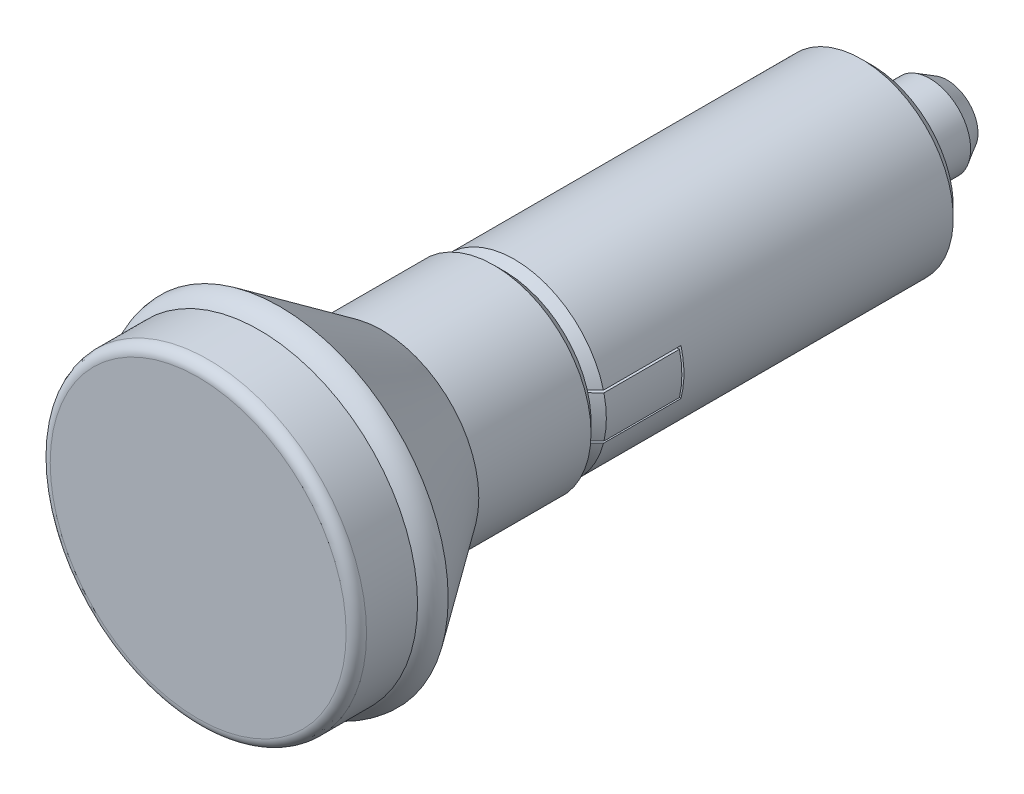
ISO-10303-21;
HEADER;
FILE_DESCRIPTION(('STEP AP214'),'2;1');
FILE_NAME('part.step','',(''),(''),'','','');
FILE_SCHEMA(('AUTOMOTIVE_DESIGN { 1 0 10303 214 1 1 1 1 }'));
ENDSEC;
DATA;
#1=APPLICATION_CONTEXT('core data for automotive mechanical design processes');
#2=APPLICATION_PROTOCOL_DEFINITION('international standard','automotive_design',2000,#1);
#3=PRODUCT_CONTEXT('',#1,'mechanical');
#4=PRODUCT('Part','Part','',(#3));
#5=PRODUCT_RELATED_PRODUCT_CATEGORY('part','',(#4));
#6=PRODUCT_DEFINITION_FORMATION('','',#4);
#7=PRODUCT_DEFINITION_CONTEXT('part definition',#1,'design');
#8=PRODUCT_DEFINITION('design','',#6,#7);
#9=PRODUCT_DEFINITION_SHAPE('','',#8);
#10=(LENGTH_UNIT() NAMED_UNIT(*) SI_UNIT(.MILLI.,.METRE.));
#11=(NAMED_UNIT(*) PLANE_ANGLE_UNIT() SI_UNIT($,.RADIAN.));
#12=(NAMED_UNIT(*) SI_UNIT($,.STERADIAN.) SOLID_ANGLE_UNIT());
#13=UNCERTAINTY_MEASURE_WITH_UNIT(LENGTH_MEASURE(1.E-05),#10,'distance_accuracy_value','');
#14=(GEOMETRIC_REPRESENTATION_CONTEXT(3) GLOBAL_UNCERTAINTY_ASSIGNED_CONTEXT((#13)) GLOBAL_UNIT_ASSIGNED_CONTEXT((#10,
#11,#12)) REPRESENTATION_CONTEXT('',''));
#15=CARTESIAN_POINT('',(0.,0.,0.));
#16=DIRECTION('',(0.,0.,1.));
#17=DIRECTION('',(1.,0.,0.));
#18=AXIS2_PLACEMENT_3D('',#15,#16,#17);
#19=CARTESIAN_POINT('',(0.,0.,36.));
#20=DIRECTION('',(0.,0.,-1.));
#21=DIRECTION('',(1.,0.,0.));
#22=AXIS2_PLACEMENT_3D('',#19,#20,#21);
#23=CONICAL_SURFACE('',#22,8.,0.785398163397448);
#24=CARTESIAN_POINT('',(4.36301272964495,-2.25,39.0909899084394));
#25=CARTESIAN_POINT('',(4.50246665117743,-2.25,38.9670205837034));
#26=CARTESIAN_POINT('',(4.64132469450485,-2.25,38.8423852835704));
#27=CARTESIAN_POINT('',(4.91805103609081,-2.25,38.5920260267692));
#28=CARTESIAN_POINT('',(5.05591935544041,-2.25,38.4663020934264));
#29=CARTESIAN_POINT('',(5.3308650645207,-2.25,38.2140119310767));
#30=CARTESIAN_POINT('',(5.46794250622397,-2.25,38.0874457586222));
#31=CARTESIAN_POINT('',(5.74145630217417,-2.25,37.8336212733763));
#32=CARTESIAN_POINT('',(5.87789265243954,-2.25,37.7063629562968));
#33=CARTESIAN_POINT('',(6.2863839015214,-2.25,37.3237757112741));
#34=CARTESIAN_POINT('',(6.55765152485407,-2.25,37.0676063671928));
#35=CARTESIAN_POINT('',(7.09871858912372,-2.25,36.5537134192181));
#36=CARTESIAN_POINT('',(7.36851799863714,-2.25,36.2959897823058));
#37=CARTESIAN_POINT('',(7.92302738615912,-2.25,35.7640811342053));
#38=CARTESIAN_POINT('',(8.20767141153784,-2.25,35.4898274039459));
#39=CARTESIAN_POINT('',(8.77606216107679,-2.25,34.9403915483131));
#40=CARTESIAN_POINT('',(9.05980888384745,-2.25,34.6652094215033));
#41=CARTESIAN_POINT('',(9.91003670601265,-2.25,33.8386250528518));
#42=CARTESIAN_POINT('',(10.475506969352,-2.25,33.2861833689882));
#43=CARTESIAN_POINT('',(11.6049167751,-2.25,32.1795069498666));
#44=CARTESIAN_POINT('',(12.1688559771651,-2.25,31.6252718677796));
#45=CARTESIAN_POINT('',(13.0139348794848,-2.25,30.7930842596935));
#46=CARTESIAN_POINT('',(13.2954876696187,-2.25,30.5155510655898));
#47=CARTESIAN_POINT('',(13.8583614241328,-2.25,29.9602501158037));
#48=CARTESIAN_POINT('',(14.1396823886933,-2.25,29.682482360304));
#49=CARTESIAN_POINT('',(14.4209094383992,-2.25,29.4046195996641));
#50=B_SPLINE_CURVE_WITH_KNOTS('',3,(#24,#25,#26,#27,#28,#29,#30,#31,#32,#33,#34,#35,#36,#37,#38,
#39,#40,#41,#42,#43,#44,#45,#46,#47,#48,#49),.UNSPECIFIED.,.F.,.F.,(4,2,2,2,2,2,2,2,2,2,2,2,4),
(0.,0.559763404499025,1.11951484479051,1.67922907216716,2.23894677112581,3.35825765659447,
4.47759240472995,5.66339545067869,6.84920033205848,9.22080380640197,11.5928972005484,
12.778928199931,13.9649582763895),.UNSPECIFIED.);
#51=CARTESIAN_POINT('',(7.67707626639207,-2.25,36.));
#52=VERTEX_POINT('',#51);
#53=CARTESIAN_POINT('',(8.71421252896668,-2.25,35.));
#54=VERTEX_POINT('',#53);
#55=EDGE_CURVE('E37',#52,#54,#50,.T.);
#56=ORIENTED_EDGE('',*,*,#55,.F.);
#57=CARTESIAN_POINT('',(0.,0.,36.));
#58=DIRECTION('',(0.,0.,1.));
#59=DIRECTION('',(-1.,0.,0.));
#60=AXIS2_PLACEMENT_3D('',#57,#58,#59);
#61=CIRCLE('',#60,8.);
#62=CARTESIAN_POINT('',(7.67707626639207,2.25,36.));
#63=VERTEX_POINT('',#62);
#64=EDGE_CURVE('E208',#63,#52,#61,.T.);
#65=ORIENTED_EDGE('',*,*,#64,.F.);
#66=CARTESIAN_POINT('',(14.4209094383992,2.25,29.4046195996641));
#67=CARTESIAN_POINT('',(14.1396823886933,2.25,29.682482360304));
#68=CARTESIAN_POINT('',(13.8583614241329,2.25,29.9602501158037));
#69=CARTESIAN_POINT('',(13.2954876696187,2.25,30.5155510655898));
#70=CARTESIAN_POINT('',(13.0139348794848,2.25,30.7930842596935));
#71=CARTESIAN_POINT('',(12.1688559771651,2.25,31.6252718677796));
#72=CARTESIAN_POINT('',(11.6049167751,2.25,32.1795069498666));
#73=CARTESIAN_POINT('',(10.475506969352,2.25,33.2861833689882));
#74=CARTESIAN_POINT('',(9.91003670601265,2.25,33.8386250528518));
#75=CARTESIAN_POINT('',(9.05980888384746,2.25,34.6652094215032));
#76=CARTESIAN_POINT('',(8.77606216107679,2.25,34.9403915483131));
#77=CARTESIAN_POINT('',(8.20767141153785,2.25,35.4898274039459));
#78=CARTESIAN_POINT('',(7.92302738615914,2.25,35.7640811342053));
#79=CARTESIAN_POINT('',(7.36851799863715,2.25,36.2959897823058));
#80=CARTESIAN_POINT('',(7.09871858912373,2.25,36.5537134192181));
#81=CARTESIAN_POINT('',(6.55765152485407,2.25,37.0676063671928));
#82=CARTESIAN_POINT('',(6.2863839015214,2.25,37.3237757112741));
#83=CARTESIAN_POINT('',(5.87789265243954,2.25,37.7063629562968));
#84=CARTESIAN_POINT('',(5.74145630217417,2.25,37.8336212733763));
#85=CARTESIAN_POINT('',(5.46794250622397,2.25,38.0874457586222));
#86=CARTESIAN_POINT('',(5.3308650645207,2.25,38.2140119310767));
#87=CARTESIAN_POINT('',(5.05591935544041,2.25,38.4663020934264));
#88=CARTESIAN_POINT('',(4.91805103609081,2.25,38.5920260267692));
#89=CARTESIAN_POINT('',(4.64132469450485,2.25,38.8423852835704));
#90=CARTESIAN_POINT('',(4.50246665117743,2.25,38.9670205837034));
#91=CARTESIAN_POINT('',(4.36301272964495,2.25,39.0909899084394));
#92=B_SPLINE_CURVE_WITH_KNOTS('',3,(#66,#67,#68,#69,#70,#71,#72,#73,#74,#75,#76,#77,#78,#79,#80,
#81,#82,#83,#84,#85,#86,#87,#88,#89,#90,#91),.UNSPECIFIED.,.F.,.F.,(4,2,2,2,2,2,2,2,2,2,2,2,4),
(0.,1.18603007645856,2.37206107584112,4.74415446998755,7.11575794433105,8.30156282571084,
9.48736587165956,10.6067006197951,11.7260115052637,12.2857292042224,12.845443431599,
13.4051948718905,13.9649582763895),.UNSPECIFIED.);
#93=CARTESIAN_POINT('',(8.71421252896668,2.25,35.));
#94=VERTEX_POINT('',#93);
#95=EDGE_CURVE('E130',#94,#63,#92,.T.);
#96=ORIENTED_EDGE('',*,*,#95,.F.);
#97=CARTESIAN_POINT('',(0.,0.,35.));
#98=DIRECTION('',(0.,0.,1.));
#99=DIRECTION('',(-1.,0.,0.));
#100=AXIS2_PLACEMENT_3D('',#97,#98,#99);
#101=CIRCLE('',#100,9.);
#102=EDGE_CURVE('E210',#94,#54,#101,.T.);
#103=ORIENTED_EDGE('',*,*,#102,.T.);
#104=EDGE_LOOP('',(#56,#65,#96,#103));
#105=FACE_BOUND('',#104,.T.);
#106=ADVANCED_FACE('F14',(#105),#23,.T.);
#107=CARTESIAN_POINT('',(0.,0.,66.));
#108=DIRECTION('',(0.,0.,1.));
#109=DIRECTION('',(-1.,0.,0.));
#110=AXIS2_PLACEMENT_3D('',#107,#108,#109);
#111=CYLINDRICAL_SURFACE('',#110,9.);
#112=CARTESIAN_POINT('',(0.,0.,27.6));
#113=DIRECTION('',(0.,0.,1.));
#114=DIRECTION('',(-1.,0.,0.));
#115=AXIS2_PLACEMENT_3D('',#112,#113,#114);
#116=CIRCLE('',#115,9.);
#117=CARTESIAN_POINT('',(8.76341828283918,2.05,27.6));
#118=VERTEX_POINT('',#117);
#119=CARTESIAN_POINT('',(8.76341828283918,-2.05,27.6));
#120=VERTEX_POINT('',#119);
#121=EDGE_CURVE('E246',#118,#120,#116,.F.);
#122=ORIENTED_EDGE('',*,*,#121,.F.);
#123=DIRECTION('',(0.,0.,1.));
#124=VECTOR('',#123,1.);
#125=CARTESIAN_POINT('',(8.76341828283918,2.05,66.));
#126=LINE('',#125,#124);
#127=CARTESIAN_POINT('',(8.76341828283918,2.05,35.));
#128=VERTEX_POINT('',#127);
#129=EDGE_CURVE('E9',#128,#118,#126,.F.);
#130=ORIENTED_EDGE('',*,*,#129,.F.);
#131=CARTESIAN_POINT('',(8.76341828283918,-2.05,35.));
#132=VERTEX_POINT('',#131);
#133=EDGE_CURVE('E218',#132,#128,#101,.T.);
#134=ORIENTED_EDGE('',*,*,#133,.F.);
#135=DIRECTION('',(0.,0.,1.));
#136=VECTOR('',#135,1.);
#137=CARTESIAN_POINT('',(8.76341828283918,-2.05,66.));
#138=LINE('',#137,#136);
#139=EDGE_CURVE('E248',#120,#132,#138,.T.);
#140=ORIENTED_EDGE('',*,*,#139,.F.);
#141=EDGE_LOOP('',(#122,#130,#134,#140));
#142=FACE_BOUND('',#141,.T.);
#143=ADVANCED_FACE('F190',(#142),#111,.T.);
#144=CARTESIAN_POINT('',(0.,0.,1.25141216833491E-10));
#145=DIRECTION('',(0.,0.,1.));
#146=DIRECTION('',(0.,-1.,0.));
#147=AXIS2_PLACEMENT_3D('',#144,#145,#146);
#148=SPHERICAL_SURFACE('',#147,8.);
#149=CARTESIAN_POINT('',(0.,0.,-7.4113534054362));
#150=DIRECTION('',(0.,0.,1.));
#151=DIRECTION('',(-1.,0.,0.));
#152=AXIS2_PLACEMENT_3D('',#149,#150,#151);
#153=CIRCLE('',#152,3.01194965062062);
#154=CARTESIAN_POINT('',(-3.01194965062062,0.,-7.4113534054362));
#155=VERTEX_POINT('',#154);
#156=EDGE_CURVE('E211',#155,#155,#153,.T.);
#157=ORIENTED_EDGE('',*,*,#156,.F.);
#158=EDGE_LOOP('',(#157));
#159=FACE_BOUND('',#158,.T.);
#160=ADVANCED_FACE('F16',(#159),#148,.T.);
#161=CARTESIAN_POINT('',(0.,-14.5,66.));
#162=DIRECTION('',(0.,0.,1.));
#163=DIRECTION('',(-1.,0.,0.));
#164=AXIS2_PLACEMENT_3D('',#161,#162,#163);
#165=PLANE('',#164);
#166=CARTESIAN_POINT('',(0.,0.,66.));
#167=DIRECTION('',(0.,0.,1.));
#168=DIRECTION('',(-1.,0.,0.));
#169=AXIS2_PLACEMENT_3D('',#166,#167,#168);
#170=CIRCLE('',#169,14.5);
#171=CARTESIAN_POINT('',(-14.5,0.,66.));
#172=VERTEX_POINT('',#171);
#173=EDGE_CURVE('E243',#172,#172,#170,.T.);
#174=ORIENTED_EDGE('',*,*,#173,.T.);
#175=EDGE_LOOP('',(#174));
#176=FACE_BOUND('',#175,.T.);
#177=ADVANCED_FACE('F383',(#176),#165,.T.);
#178=CARTESIAN_POINT('',(0.,0.,65.));
#179=DIRECTION('',(0.,0.,1.));
#180=DIRECTION('',(-1.,0.,0.));
#181=AXIS2_PLACEMENT_3D('',#178,#179,#180);
#182=TOROIDAL_SURFACE('',#181,14.5,1.);
#183=CARTESIAN_POINT('',(0.,0.,65.));
#184=DIRECTION('',(0.,0.,1.));
#185=DIRECTION('',(-1.,0.,0.));
#186=AXIS2_PLACEMENT_3D('',#183,#184,#185);
#187=CIRCLE('',#186,15.5);
#188=CARTESIAN_POINT('',(-15.5,0.,65.));
#189=VERTEX_POINT('',#188);
#190=EDGE_CURVE('E240',#189,#189,#187,.T.);
#191=ORIENTED_EDGE('',*,*,#190,.T.);
#192=EDGE_LOOP('',(#191));
#193=FACE_BOUND('',#192,.T.);
#194=ORIENTED_EDGE('',*,*,#173,.F.);
#195=EDGE_LOOP('',(#194));
#196=FACE_BOUND('',#195,.T.);
#197=ADVANCED_FACE('F374',(#193,#196),#182,.T.);
#198=CARTESIAN_POINT('',(0.,0.,66.));
#199=DIRECTION('',(0.,0.,1.));
#200=DIRECTION('',(-1.,0.,0.));
#201=AXIS2_PLACEMENT_3D('',#198,#199,#200);
#202=CYLINDRICAL_SURFACE('',#201,15.5);
#203=CARTESIAN_POINT('',(0.,0.,60.));
#204=DIRECTION('',(0.,0.,1.));
#205=DIRECTION('',(-1.,0.,0.));
#206=AXIS2_PLACEMENT_3D('',#203,#204,#205);
#207=CIRCLE('',#206,15.5);
#208=CARTESIAN_POINT('',(-15.5,0.,60.));
#209=VERTEX_POINT('',#208);
#210=EDGE_CURVE('E237',#209,#209,#207,.T.);
#211=ORIENTED_EDGE('',*,*,#210,.T.);
#212=EDGE_LOOP('',(#211));
#213=FACE_BOUND('',#212,.T.);
#214=ORIENTED_EDGE('',*,*,#190,.F.);
#215=EDGE_LOOP('',(#214));
#216=FACE_BOUND('',#215,.T.);
#217=ADVANCED_FACE('F365',(#213,#216),#202,.T.);
#218=CARTESIAN_POINT('',(0.,0.,58.));
#219=DIRECTION('',(0.,0.,1.));
#220=DIRECTION('',(-1.,0.,0.));
#221=AXIS2_PLACEMENT_3D('',#218,#219,#220);
#222=TOROIDAL_SURFACE('',#221,14.0000000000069,2.49999999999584);
#223=CARTESIAN_POINT('',(0.,0.,58.));
#224=DIRECTION('',(0.,0.,1.));
#225=DIRECTION('',(-1.,0.,0.));
#226=AXIS2_PLACEMENT_3D('',#223,#224,#225);
#227=CIRCLE('',#226,16.5000000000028);
#228=CARTESIAN_POINT('',(-16.5000000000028,0.,58.));
#229=VERTEX_POINT('',#228);
#230=EDGE_CURVE('E234',#229,#229,#227,.T.);
#231=ORIENTED_EDGE('',*,*,#230,.T.);
#232=EDGE_LOOP('',(#231));
#233=FACE_BOUND('',#232,.T.);
#234=ORIENTED_EDGE('',*,*,#210,.F.);
#235=EDGE_LOOP('',(#234));
#236=FACE_BOUND('',#235,.T.);
#237=ADVANCED_FACE('F356',(#233,#236),#222,.T.);
#238=CARTESIAN_POINT('',(0.,0.,58.));
#239=DIRECTION('',(0.,0.,1.));
#240=DIRECTION('',(-1.,0.,0.));
#241=AXIS2_PLACEMENT_3D('',#238,#239,#240);
#242=CONICAL_SURFACE('',#241,16.5000000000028,0.610725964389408);
#243=CARTESIAN_POINT('',(0.,0.,48.));
#244=DIRECTION('',(0.,0.,1.));
#245=DIRECTION('',(-1.,0.,0.));
#246=AXIS2_PLACEMENT_3D('',#243,#244,#245);
#247=CIRCLE('',#246,9.5);
#248=CARTESIAN_POINT('',(-9.5,0.,48.));
#249=VERTEX_POINT('',#248);
#250=EDGE_CURVE('E231',#249,#249,#247,.T.);
#251=ORIENTED_EDGE('',*,*,#250,.T.);
#252=EDGE_LOOP('',(#251));
#253=FACE_BOUND('',#252,.T.);
#254=ORIENTED_EDGE('',*,*,#230,.F.);
#255=EDGE_LOOP('',(#254));
#256=FACE_BOUND('',#255,.T.);
#257=ADVANCED_FACE('F347',(#253,#256),#242,.T.);
#258=CARTESIAN_POINT('',(0.,0.,66.));
#259=DIRECTION('',(0.,0.,1.));
#260=DIRECTION('',(-1.,0.,0.));
#261=AXIS2_PLACEMENT_3D('',#258,#259,#260);
#262=CYLINDRICAL_SURFACE('',#261,9.5);
#263=CARTESIAN_POINT('',(0.,0.,37.));
#264=DIRECTION('',(0.,0.,1.));
#265=DIRECTION('',(-1.,0.,0.));
#266=AXIS2_PLACEMENT_3D('',#263,#264,#265);
#267=CIRCLE('',#266,9.5);
#268=CARTESIAN_POINT('',(-9.5,0.,37.));
#269=VERTEX_POINT('',#268);
#270=EDGE_CURVE('E228',#269,#269,#267,.T.);
#271=ORIENTED_EDGE('',*,*,#270,.T.);
#272=EDGE_LOOP('',(#271));
#273=FACE_BOUND('',#272,.T.);
#274=ORIENTED_EDGE('',*,*,#250,.F.);
#275=EDGE_LOOP('',(#274));
#276=FACE_BOUND('',#275,.T.);
#277=ADVANCED_FACE('F338',(#273,#276),#262,.T.);
#278=CARTESIAN_POINT('',(0.,0.,37.));
#279=DIRECTION('',(0.,0.,1.));
#280=DIRECTION('',(-1.,0.,0.));
#281=AXIS2_PLACEMENT_3D('',#278,#279,#280);
#282=CONICAL_SURFACE('',#281,9.5,0.785398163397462);
#283=CARTESIAN_POINT('',(0.,0.,36.));
#284=DIRECTION('',(0.,0.,1.));
#285=DIRECTION('',(-1.,0.,0.));
#286=AXIS2_PLACEMENT_3D('',#283,#284,#285);
#287=CIRCLE('',#286,8.5);
#288=CARTESIAN_POINT('',(-8.5,0.,36.));
#289=VERTEX_POINT('',#288);
#290=EDGE_CURVE('E221',#289,#289,#287,.T.);
#291=ORIENTED_EDGE('',*,*,#290,.T.);
#292=EDGE_LOOP('',(#291));
#293=FACE_BOUND('',#292,.T.);
#294=ORIENTED_EDGE('',*,*,#270,.F.);
#295=EDGE_LOOP('',(#294));
#296=FACE_BOUND('',#295,.T.);
#297=ADVANCED_FACE('F330',(#293,#296),#282,.T.);
#298=CARTESIAN_POINT('',(0.,-8.5,36.));
#299=DIRECTION('',(0.,0.,-1.));
#300=DIRECTION('',(1.,0.,0.));
#301=AXIS2_PLACEMENT_3D('',#298,#299,#300);
#302=PLANE('',#301);
#303=ORIENTED_EDGE('',*,*,#64,.T.);
#304=DIRECTION('',(1.,0.,0.));
#305=VECTOR('',#304,1.);
#306=CARTESIAN_POINT('',(4.,-2.25,36.));
#307=LINE('',#306,#305);
#308=CARTESIAN_POINT('',(4.,-2.25,36.));
#309=VERTEX_POINT('',#308);
#310=EDGE_CURVE('E131',#309,#52,#307,.T.);
#311=ORIENTED_EDGE('',*,*,#310,.F.);
#312=DIRECTION('',(0.,-1.,0.));
#313=VECTOR('',#312,1.);
#314=CARTESIAN_POINT('',(4.,-2.25,36.));
#315=LINE('',#314,#313);
#316=CARTESIAN_POINT('',(4.,-2.05,36.));
#317=VERTEX_POINT('',#316);
#318=EDGE_CURVE('E125',#317,#309,#315,.T.);
#319=ORIENTED_EDGE('',*,*,#318,.F.);
#320=DIRECTION('',(1.,0.,0.));
#321=VECTOR('',#320,1.);
#322=CARTESIAN_POINT('',(4.,-2.05,36.));
#323=LINE('',#322,#321);
#324=CARTESIAN_POINT('',(7.73288432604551,-2.05,36.));
#325=VERTEX_POINT('',#324);
#326=EDGE_CURVE('E133',#317,#325,#323,.T.);
#327=ORIENTED_EDGE('',*,*,#326,.T.);
#328=CARTESIAN_POINT('',(7.73288432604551,2.05,36.));
#329=VERTEX_POINT('',#328);
#330=EDGE_CURVE('E217',#325,#329,#61,.T.);
#331=ORIENTED_EDGE('',*,*,#330,.T.);
#332=DIRECTION('',(1.,0.,0.));
#333=VECTOR('',#332,1.);
#334=CARTESIAN_POINT('',(4.,2.05,36.));
#335=LINE('',#334,#333);
#336=CARTESIAN_POINT('',(4.,2.05,36.));
#337=VERTEX_POINT('',#336);
#338=EDGE_CURVE('E142',#337,#329,#335,.T.);
#339=ORIENTED_EDGE('',*,*,#338,.F.);
#340=DIRECTION('',(0.,-1.,0.));
#341=VECTOR('',#340,1.);
#342=CARTESIAN_POINT('',(4.,2.25,36.));
#343=LINE('',#342,#341);
#344=CARTESIAN_POINT('',(4.,2.25,36.));
#345=VERTEX_POINT('',#344);
#346=EDGE_CURVE('E108',#345,#337,#343,.T.);
#347=ORIENTED_EDGE('',*,*,#346,.F.);
#348=DIRECTION('',(1.,0.,0.));
#349=VECTOR('',#348,1.);
#350=CARTESIAN_POINT('',(4.,2.25,36.));
#351=LINE('',#350,#349);
#352=EDGE_CURVE('E98',#345,#63,#351,.T.);
#353=ORIENTED_EDGE('',*,*,#352,.T.);
#354=EDGE_LOOP('',(#303,#311,#319,#327,#331,#339,#347,#353));
#355=FACE_BOUND('',#354,.T.);
#356=ORIENTED_EDGE('',*,*,#290,.F.);
#357=EDGE_LOOP('',(#356));
#358=FACE_BOUND('',#357,.T.);
#359=ADVANCED_FACE('F195',(#355,#358),#302,.T.);
#360=CARTESIAN_POINT('',(14.4372589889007,-2.05,29.4179237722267));
#361=CARTESIAN_POINT('',(14.1563248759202,-2.05,29.696065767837));
#362=CARTESIAN_POINT('',(13.8753127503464,-2.05,29.9741289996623));
#363=CARTESIAN_POINT('',(13.313095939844,-2.05,30.5300610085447));
#364=CARTESIAN_POINT('',(13.0318912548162,-2.05,30.8079297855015));
#365=CARTESIAN_POINT('',(12.1879317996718,-2.05,31.6411907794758));
#366=CARTESIAN_POINT('',(11.6248338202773,-2.05,32.1962354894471));
#367=CARTESIAN_POINT('',(10.4973626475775,-2.05,33.3048406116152));
#368=CARTESIAN_POINT('',(9.93298968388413,-2.05,33.8584012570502));
#369=CARTESIAN_POINT('',(9.0847468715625,-2.05,34.6870231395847));
#370=CARTESIAN_POINT('',(8.80171777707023,-2.05,34.9629448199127));
#371=CARTESIAN_POINT('',(8.23491248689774,-2.05,35.514019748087));
#372=CARTESIAN_POINT('',(7.95113629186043,-2.05,35.7891729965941));
#373=CARTESIAN_POINT('',(7.37188571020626,-2.05,36.3487654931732));
#374=CARTESIAN_POINT('',(7.07637273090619,-2.05,36.6331648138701));
#375=CARTESIAN_POINT('',(6.48382434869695,-2.05,37.2003626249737));
#376=CARTESIAN_POINT('',(6.18678898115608,-2.05,37.4831611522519));
#377=CARTESIAN_POINT('',(5.73951213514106,-2.05,37.9055661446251));
#378=CARTESIAN_POINT('',(5.59012454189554,-2.05,38.0460764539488));
#379=CARTESIAN_POINT('',(5.29063417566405,-2.05,38.3263309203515));
#380=CARTESIAN_POINT('',(5.14053140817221,-2.05,38.4660750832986));
#381=CARTESIAN_POINT('',(4.83941846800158,-2.05,38.744606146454));
#382=CARTESIAN_POINT('',(4.68840823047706,-2.05,38.8833929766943));
#383=CARTESIAN_POINT('',(4.38520556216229,-2.05,39.1596764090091));
#384=CARTESIAN_POINT('',(4.23301310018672,-2.05,39.2971729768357));
#385=CARTESIAN_POINT('',(4.08009073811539,-2.05,39.433859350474));
#386=B_SPLINE_CURVE_WITH_KNOTS('',3,(#360,#361,#362,#363,#364,#365,#366,#367,#368,#369,#370,
#371,#372,#373,#374,#375,#376,#377,#378,#379,#380,#381,#382,#383,#384,#385),.UNSPECIFIED.,.F.,
.F.,(4,2,2,2,2,2,2,2,2,2,2,2,4),(0.,1.1859943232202,2.37198925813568,4.74398837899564,
7.11558984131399,8.30139833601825,9.48720581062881,10.7176079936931,11.9479817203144,
12.5632342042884,13.1784819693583,13.7937742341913,14.409082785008),.UNSPECIFIED.);
#387=EDGE_CURVE('E212',#132,#325,#386,.T.);
#388=ORIENTED_EDGE('',*,*,#387,.F.);
#389=ORIENTED_EDGE('',*,*,#133,.T.);
#390=CARTESIAN_POINT('',(4.08009073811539,2.05,39.433859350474));
#391=CARTESIAN_POINT('',(4.23301310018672,2.05,39.2971729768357));
#392=CARTESIAN_POINT('',(4.38520556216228,2.05,39.1596764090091));
#393=CARTESIAN_POINT('',(4.68840823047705,2.05,38.8833929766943));
#394=CARTESIAN_POINT('',(4.83941846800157,2.05,38.744606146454));
#395=CARTESIAN_POINT('',(5.1405314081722,2.05,38.4660750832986));
#396=CARTESIAN_POINT('',(5.29063417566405,2.05,38.3263309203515));
#397=CARTESIAN_POINT('',(5.59012454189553,2.05,38.0460764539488));
#398=CARTESIAN_POINT('',(5.73951213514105,2.05,37.9055661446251));
#399=CARTESIAN_POINT('',(6.18678898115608,2.05,37.4831611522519));
#400=CARTESIAN_POINT('',(6.48382434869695,2.05,37.2003626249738));
#401=CARTESIAN_POINT('',(7.07637273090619,2.05,36.6331648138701));
#402=CARTESIAN_POINT('',(7.37188571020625,2.05,36.3487654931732));
#403=CARTESIAN_POINT('',(7.95113629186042,2.05,35.7891729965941));
#404=CARTESIAN_POINT('',(8.23491248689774,2.05,35.514019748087));
#405=CARTESIAN_POINT('',(8.80171777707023,2.05,34.9629448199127));
#406=CARTESIAN_POINT('',(9.0847468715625,2.05,34.6870231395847));
#407=CARTESIAN_POINT('',(9.93298968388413,2.05,33.8584012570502));
#408=CARTESIAN_POINT('',(10.4973626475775,2.05,33.3048406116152));
#409=CARTESIAN_POINT('',(11.6248338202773,2.05,32.1962354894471));
#410=CARTESIAN_POINT('',(12.1879317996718,2.05,31.6411907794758));
#411=CARTESIAN_POINT('',(13.0318912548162,2.05,30.8079297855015));
#412=CARTESIAN_POINT('',(13.313095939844,2.05,30.5300610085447));
#413=CARTESIAN_POINT('',(13.8753127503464,2.05,29.9741289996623));
#414=CARTESIAN_POINT('',(14.1563248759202,2.05,29.696065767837));
#415=CARTESIAN_POINT('',(14.4372589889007,2.05,29.4179237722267));
#416=B_SPLINE_CURVE_WITH_KNOTS('',3,(#390,#391,#392,#393,#394,#395,#396,#397,#398,#399,#400,
#401,#402,#403,#404,#405,#406,#407,#408,#409,#410,#411,#412,#413,#414,#415),.UNSPECIFIED.,.F.,
.F.,(4,2,2,2,2,2,2,2,2,2,2,2,4),(0.,0.615308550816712,1.23060081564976,1.84584858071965,
2.46110106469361,3.69147479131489,4.92187697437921,6.10768444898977,7.29349294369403,
9.66509440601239,12.0370935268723,13.2230884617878,14.409082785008),.UNSPECIFIED.);
#417=EDGE_CURVE('E152',#329,#128,#416,.T.);
#418=ORIENTED_EDGE('',*,*,#417,.F.);
#419=ORIENTED_EDGE('',*,*,#330,.F.);
#420=EDGE_LOOP('',(#388,#389,#418,#419));
#421=FACE_BOUND('',#420,.T.);
#422=ADVANCED_FACE('F159',(#421),#23,.T.);
#423=DIRECTION('',(0.,0.,1.));
#424=VECTOR('',#423,1.);
#425=CARTESIAN_POINT('',(8.71421252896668,2.25,66.));
#426=LINE('',#425,#424);
#427=CARTESIAN_POINT('',(8.71421252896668,2.25,27.4));
#428=VERTEX_POINT('',#427);
#429=EDGE_CURVE('E22',#428,#94,#426,.T.);
#430=ORIENTED_EDGE('',*,*,#429,.F.);
#431=CARTESIAN_POINT('',(0.,0.,27.4));
#432=DIRECTION('',(0.,0.,-1.));
#433=DIRECTION('',(1.,0.,0.));
#434=AXIS2_PLACEMENT_3D('',#431,#432,#433);
#435=CIRCLE('',#434,9.);
#436=CARTESIAN_POINT('',(8.71421252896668,-2.25,27.4));
#437=VERTEX_POINT('',#436);
#438=EDGE_CURVE('E29',#437,#428,#435,.F.);
#439=ORIENTED_EDGE('',*,*,#438,.F.);
#440=DIRECTION('',(0.,0.,1.));
#441=VECTOR('',#440,1.);
#442=CARTESIAN_POINT('',(8.71421252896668,-2.25,66.));
#443=LINE('',#442,#441);
#444=EDGE_CURVE('E251',#54,#437,#443,.F.);
#445=ORIENTED_EDGE('',*,*,#444,.F.);
#446=ORIENTED_EDGE('',*,*,#102,.F.);
#447=EDGE_LOOP('',(#430,#439,#445,#446));
#448=FACE_BOUND('',#447,.T.);
#449=CARTESIAN_POINT('',(0.,0.,1.));
#450=DIRECTION('',(0.,0.,1.));
#451=DIRECTION('',(-1.,0.,0.));
#452=AXIS2_PLACEMENT_3D('',#449,#450,#451);
#453=CIRCLE('',#452,9.);
#454=CARTESIAN_POINT('',(-9.,0.,1.));
#455=VERTEX_POINT('',#454);
#456=EDGE_CURVE('E252',#455,#455,#453,.T.);
#457=ORIENTED_EDGE('',*,*,#456,.T.);
#458=EDGE_LOOP('',(#457));
#459=FACE_BOUND('',#458,.T.);
#460=ADVANCED_FACE('F186',(#448,#459),#111,.T.);
#461=CARTESIAN_POINT('',(0.,0.,1.));
#462=DIRECTION('',(0.,0.,1.));
#463=DIRECTION('',(-1.,0.,0.));
#464=AXIS2_PLACEMENT_3D('',#461,#462,#463);
#465=CONICAL_SURFACE('',#464,9.,0.785398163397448);
#466=CARTESIAN_POINT('',(0.,0.,0.));
#467=DIRECTION('',(0.,0.,1.));
#468=DIRECTION('',(-1.,0.,0.));
#469=AXIS2_PLACEMENT_3D('',#466,#467,#468);
#470=CIRCLE('',#469,8.);
#471=CARTESIAN_POINT('',(-8.,0.,0.));
#472=VERTEX_POINT('',#471);
#473=EDGE_CURVE('E254',#472,#472,#470,.T.);
#474=ORIENTED_EDGE('',*,*,#473,.T.);
#475=EDGE_LOOP('',(#474));
#476=FACE_BOUND('',#475,.T.);
#477=ORIENTED_EDGE('',*,*,#456,.F.);
#478=EDGE_LOOP('',(#477));
#479=FACE_BOUND('',#478,.T.);
#480=ADVANCED_FACE('F183',(#476,#479),#465,.T.);
#481=CARTESIAN_POINT('',(0.,-4.00000000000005,0.));
#482=DIRECTION('',(0.,0.,-1.));
#483=DIRECTION('',(1.,0.,0.));
#484=AXIS2_PLACEMENT_3D('',#481,#482,#483);
#485=PLANE('',#484);
#486=CARTESIAN_POINT('',(0.,0.,0.));
#487=DIRECTION('',(0.,0.,1.));
#488=DIRECTION('',(-1.,0.,0.));
#489=AXIS2_PLACEMENT_3D('',#486,#487,#488);
#490=CIRCLE('',#489,4.00000000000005);
#491=CARTESIAN_POINT('',(-4.00000000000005,0.,0.));
#492=VERTEX_POINT('',#491);
#493=EDGE_CURVE('E257',#492,#492,#490,.T.);
#494=ORIENTED_EDGE('',*,*,#493,.T.);
#495=EDGE_LOOP('',(#494));
#496=FACE_BOUND('',#495,.T.);
#497=ORIENTED_EDGE('',*,*,#473,.F.);
#498=EDGE_LOOP('',(#497));
#499=FACE_BOUND('',#498,.T.);
#500=ADVANCED_FACE('F179',(#496,#499),#485,.T.);
#501=CARTESIAN_POINT('',(0.,0.,66.));
#502=DIRECTION('',(0.,0.,1.));
#503=DIRECTION('',(-1.,0.,0.));
#504=AXIS2_PLACEMENT_3D('',#501,#502,#503);
#505=CYLINDRICAL_SURFACE('',#504,4.);
#506=CARTESIAN_POINT('',(0.,0.,-5.699999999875));
#507=DIRECTION('',(0.,0.,1.));
#508=DIRECTION('',(-1.,0.,0.));
#509=AXIS2_PLACEMENT_3D('',#506,#507,#508);
#510=CIRCLE('',#509,4.);
#511=CARTESIAN_POINT('',(-4.,0.,-5.699999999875));
#512=VERTEX_POINT('',#511);
#513=EDGE_CURVE('E262',#512,#512,#510,.T.);
#514=ORIENTED_EDGE('',*,*,#513,.T.);
#515=EDGE_LOOP('',(#514));
#516=FACE_BOUND('',#515,.T.);
#517=ORIENTED_EDGE('',*,*,#493,.F.);
#518=EDGE_LOOP('',(#517));
#519=FACE_BOUND('',#518,.T.);
#520=ADVANCED_FACE('F175',(#516,#519),#505,.T.);
#521=CARTESIAN_POINT('',(0.,0.,-5.699999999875));
#522=DIRECTION('',(0.,0.,1.));
#523=DIRECTION('',(-1.,0.,0.));
#524=AXIS2_PLACEMENT_3D('',#521,#522,#523);
#525=CONICAL_SURFACE('',#524,4.,0.523598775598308);
#526=ORIENTED_EDGE('',*,*,#156,.T.);
#527=EDGE_LOOP('',(#526));
#528=FACE_BOUND('',#527,.T.);
#529=ORIENTED_EDGE('',*,*,#513,.F.);
#530=EDGE_LOOP('',(#529));
#531=FACE_BOUND('',#530,.T.);
#532=ADVANCED_FACE('F172',(#528,#531),#525,.T.);
#533=CARTESIAN_POINT('',(4.,-2.25,27.4));
#534=DIRECTION('',(0.,0.,-1.));
#535=DIRECTION('',(1.,0.,0.));
#536=AXIS2_PLACEMENT_3D('',#533,#534,#535);
#537=PLANE('',#536);
#538=ORIENTED_EDGE('',*,*,#438,.T.);
#539=DIRECTION('',(1.,0.,0.));
#540=VECTOR('',#539,1.);
#541=CARTESIAN_POINT('',(4.,2.25,27.4));
#542=LINE('',#541,#540);
#543=CARTESIAN_POINT('',(4.,2.25,27.4));
#544=VERTEX_POINT('',#543);
#545=EDGE_CURVE('E90',#544,#428,#542,.T.);
#546=ORIENTED_EDGE('',*,*,#545,.F.);
#547=DIRECTION('',(0.,1.,0.));
#548=VECTOR('',#547,1.);
#549=CARTESIAN_POINT('',(4.,-2.25,27.4));
#550=LINE('',#549,#548);
#551=CARTESIAN_POINT('',(4.,-2.25,27.4));
#552=VERTEX_POINT('',#551);
#553=EDGE_CURVE('E94',#552,#544,#550,.T.);
#554=ORIENTED_EDGE('',*,*,#553,.F.);
#555=DIRECTION('',(1.,0.,0.));
#556=VECTOR('',#555,1.);
#557=CARTESIAN_POINT('',(4.,-2.25,27.4));
#558=LINE('',#557,#556);
#559=EDGE_CURVE('E128',#552,#437,#558,.T.);
#560=ORIENTED_EDGE('',*,*,#559,.T.);
#561=EDGE_LOOP('',(#538,#546,#554,#560));
#562=FACE_BOUND('',#561,.T.);
#563=ADVANCED_FACE('F92',(#562),#537,.F.);
#564=CARTESIAN_POINT('',(4.,-2.25,27.4));
#565=DIRECTION('',(0.,-1.,0.));
#566=DIRECTION('',(1.,0.,0.));
#567=AXIS2_PLACEMENT_3D('',#564,#565,#566);
#568=PLANE('',#567);
#569=ORIENTED_EDGE('',*,*,#55,.T.);
#570=ORIENTED_EDGE('',*,*,#444,.T.);
#571=ORIENTED_EDGE('',*,*,#559,.F.);
#572=DIRECTION('',(0.,0.,-1.));
#573=VECTOR('',#572,1.);
#574=CARTESIAN_POINT('',(4.,-2.25,27.4));
#575=LINE('',#574,#573);
#576=EDGE_CURVE('E99',#309,#552,#575,.T.);
#577=ORIENTED_EDGE('',*,*,#576,.F.);
#578=ORIENTED_EDGE('',*,*,#310,.T.);
#579=EDGE_LOOP('',(#569,#570,#571,#577,#578));
#580=FACE_BOUND('',#579,.T.);
#581=ADVANCED_FACE('F171',(#580),#568,.F.);
#582=CARTESIAN_POINT('',(4.,-2.05,27.6));
#583=DIRECTION('',(0.,1.,0.));
#584=DIRECTION('',(-1.,0.,0.));
#585=AXIS2_PLACEMENT_3D('',#582,#583,#584);
#586=PLANE('',#585);
#587=ORIENTED_EDGE('',*,*,#387,.T.);
#588=ORIENTED_EDGE('',*,*,#326,.F.);
#589=DIRECTION('',(0.,0.,1.));
#590=VECTOR('',#589,1.);
#591=CARTESIAN_POINT('',(4.,-2.05,27.6));
#592=LINE('',#591,#590);
#593=CARTESIAN_POINT('',(4.,-2.05,27.6));
#594=VERTEX_POINT('',#593);
#595=EDGE_CURVE('E122',#594,#317,#592,.T.);
#596=ORIENTED_EDGE('',*,*,#595,.F.);
#597=DIRECTION('',(1.,0.,0.));
#598=VECTOR('',#597,1.);
#599=CARTESIAN_POINT('',(4.,-2.05,27.6));
#600=LINE('',#599,#598);
#601=EDGE_CURVE('E136',#594,#120,#600,.T.);
#602=ORIENTED_EDGE('',*,*,#601,.T.);
#603=ORIENTED_EDGE('',*,*,#139,.T.);
#604=EDGE_LOOP('',(#587,#588,#596,#602,#603));
#605=FACE_BOUND('',#604,.T.);
#606=ADVANCED_FACE('F279',(#605),#586,.F.);
#607=CARTESIAN_POINT('',(4.,-2.05,27.6));
#608=DIRECTION('',(0.,0.,1.));
#609=DIRECTION('',(-1.,0.,0.));
#610=AXIS2_PLACEMENT_3D('',#607,#608,#609);
#611=PLANE('',#610);
#612=DIRECTION('',(1.,0.,0.));
#613=VECTOR('',#612,1.);
#614=CARTESIAN_POINT('',(4.,2.05,27.6));
#615=LINE('',#614,#613);
#616=CARTESIAN_POINT('',(4.,2.05,27.6));
#617=VERTEX_POINT('',#616);
#618=EDGE_CURVE('E139',#617,#118,#615,.T.);
#619=ORIENTED_EDGE('',*,*,#618,.T.);
#620=ORIENTED_EDGE('',*,*,#121,.T.);
#621=ORIENTED_EDGE('',*,*,#601,.F.);
#622=DIRECTION('',(0.,-1.,0.));
#623=VECTOR('',#622,1.);
#624=CARTESIAN_POINT('',(4.,-2.05,27.6));
#625=LINE('',#624,#623);
#626=EDGE_CURVE('E119',#617,#594,#625,.T.);
#627=ORIENTED_EDGE('',*,*,#626,.F.);
#628=EDGE_LOOP('',(#619,#620,#621,#627));
#629=FACE_BOUND('',#628,.T.);
#630=ADVANCED_FACE('F282',(#629),#611,.F.);
#631=CARTESIAN_POINT('',(4.,2.05,27.6));
#632=DIRECTION('',(0.,-1.,0.));
#633=DIRECTION('',(1.,0.,0.));
#634=AXIS2_PLACEMENT_3D('',#631,#632,#633);
#635=PLANE('',#634);
#636=ORIENTED_EDGE('',*,*,#417,.T.);
#637=ORIENTED_EDGE('',*,*,#129,.T.);
#638=ORIENTED_EDGE('',*,*,#618,.F.);
#639=DIRECTION('',(0.,0.,-1.));
#640=VECTOR('',#639,1.);
#641=CARTESIAN_POINT('',(4.,2.05,27.6));
#642=LINE('',#641,#640);
#643=EDGE_CURVE('E116',#337,#617,#642,.T.);
#644=ORIENTED_EDGE('',*,*,#643,.F.);
#645=ORIENTED_EDGE('',*,*,#338,.T.);
#646=EDGE_LOOP('',(#636,#637,#638,#644,#645));
#647=FACE_BOUND('',#646,.T.);
#648=ADVANCED_FACE('F166',(#647),#635,.F.);
#649=CARTESIAN_POINT('',(4.,2.25,27.4));
#650=DIRECTION('',(0.,1.,0.));
#651=DIRECTION('',(-1.,0.,0.));
#652=AXIS2_PLACEMENT_3D('',#649,#650,#651);
#653=PLANE('',#652);
#654=ORIENTED_EDGE('',*,*,#95,.T.);
#655=ORIENTED_EDGE('',*,*,#352,.F.);
#656=DIRECTION('',(0.,0.,1.));
#657=VECTOR('',#656,1.);
#658=CARTESIAN_POINT('',(4.,2.25,27.4));
#659=LINE('',#658,#657);
#660=EDGE_CURVE('E102',#544,#345,#659,.T.);
#661=ORIENTED_EDGE('',*,*,#660,.F.);
#662=ORIENTED_EDGE('',*,*,#545,.T.);
#663=ORIENTED_EDGE('',*,*,#429,.T.);
#664=EDGE_LOOP('',(#654,#655,#661,#662,#663));
#665=FACE_BOUND('',#664,.T.);
#666=ADVANCED_FACE('F103',(#665),#653,.F.);
#667=CARTESIAN_POINT('',(4.,2.25,27.4));
#668=DIRECTION('',(1.,0.,0.));
#669=DIRECTION('',(0.,0.,1.));
#670=AXIS2_PLACEMENT_3D('',#667,#668,#669);
#671=PLANE('',#670);
#672=ORIENTED_EDGE('',*,*,#553,.T.);
#673=ORIENTED_EDGE('',*,*,#660,.T.);
#674=ORIENTED_EDGE('',*,*,#346,.T.);
#675=ORIENTED_EDGE('',*,*,#643,.T.);
#676=ORIENTED_EDGE('',*,*,#626,.T.);
#677=ORIENTED_EDGE('',*,*,#595,.T.);
#678=ORIENTED_EDGE('',*,*,#318,.T.);
#679=ORIENTED_EDGE('',*,*,#576,.T.);
#680=EDGE_LOOP('',(#672,#673,#674,#675,#676,#677,#678,#679));
#681=FACE_BOUND('',#680,.T.);
#682=ADVANCED_FACE('F110',(#681),#671,.T.);
#683=CLOSED_SHELL('',(#106,#143,#160,#177,#197,#217,#237,#257,#277,#297,#359,#422,#460,#480,
#500,#520,#532,#563,#581,#606,#630,#648,#666,#682));
#684=MANIFOLD_SOLID_BREP('B1',#683);
#685=ADVANCED_BREP_SHAPE_REPRESENTATION('',(#18,#684),#14);
#686=SHAPE_DEFINITION_REPRESENTATION(#9,#685);
ENDSEC;
END-ISO-10303-21;
